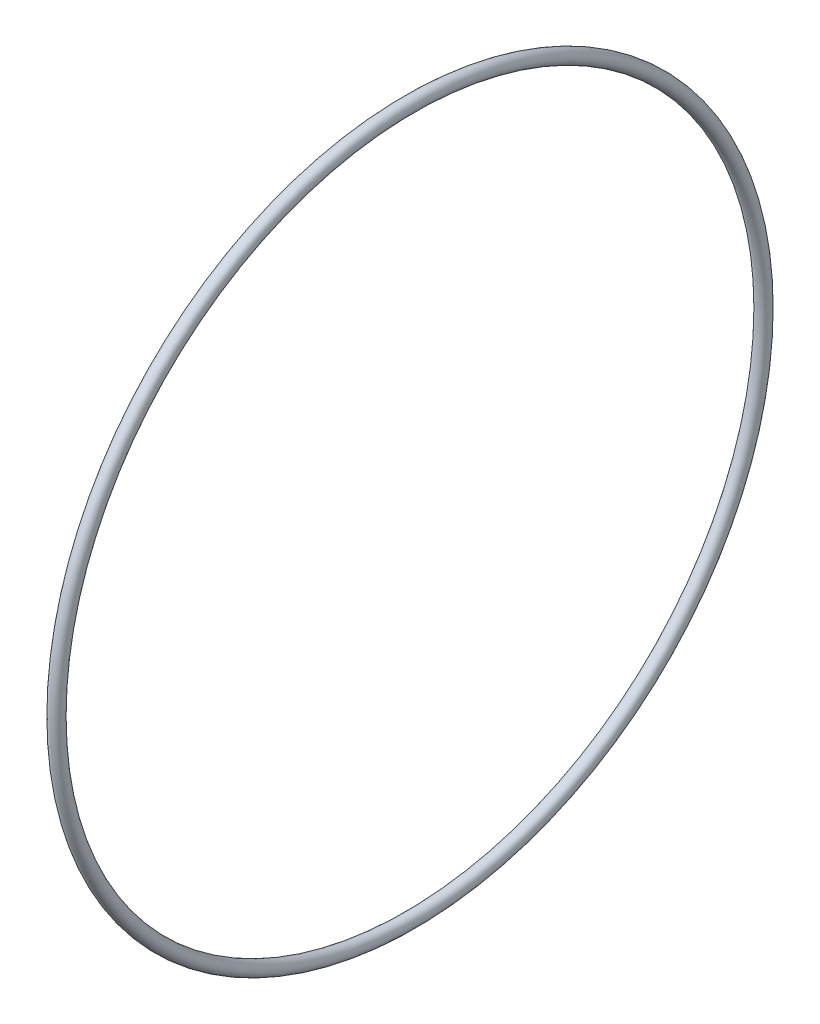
from build123d import *

# Parameters (mm, degrees)
SKETCH1_R = 1.7653


with BuildPart() as part:
    # Sketch1 → Revolve1 (revolve)
    with BuildSketch(Plane.XY, mode=Mode.PRIVATE) as revolve1_sk:
        with Locations((0, 91.5924)):
            Circle(SKETCH1_R)
    revolve(revolve1_sk.sketch.rotate(Axis((0, 0, 0), (-1, 0, 0)), 90), axis=Axis((0, 0, 0), (-1, 0, 0)))


solid = part.part
